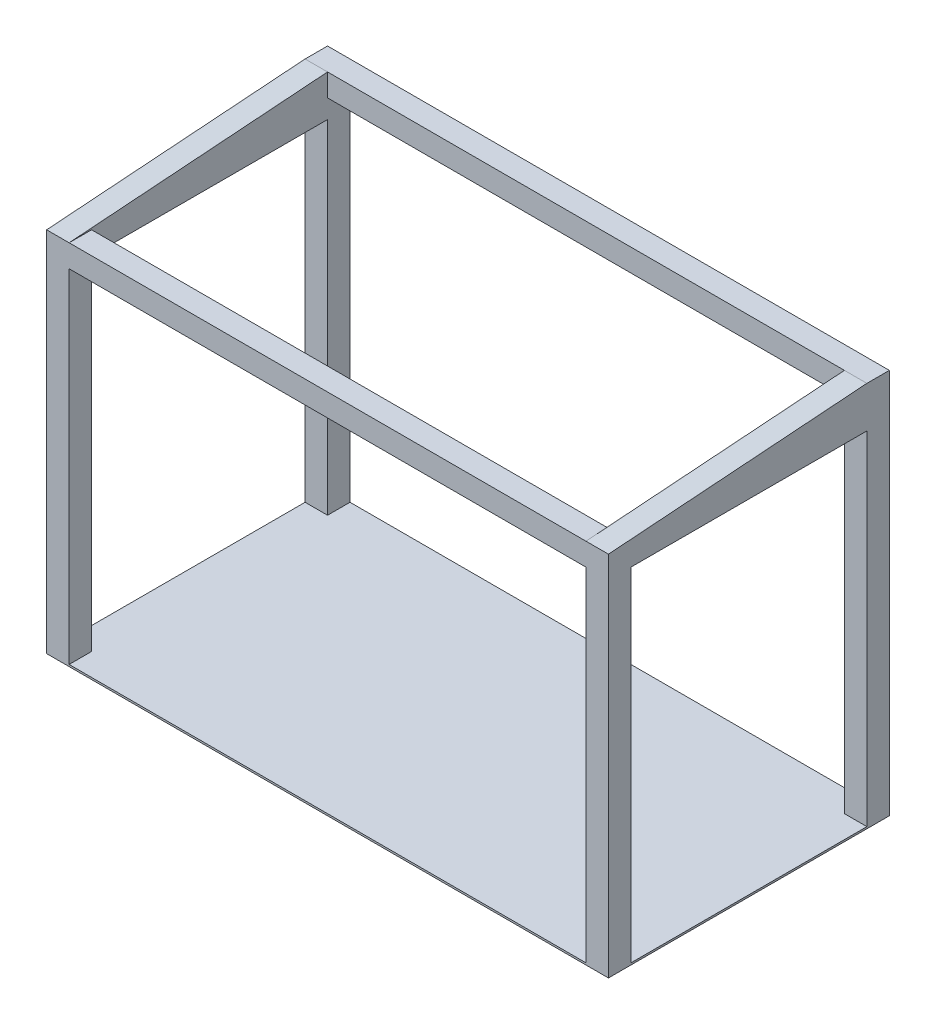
ISO-10303-21;
HEADER;
FILE_DESCRIPTION(('STEP AP214'),'2;1');
FILE_NAME('part.step','',(''),(''),'','','');
FILE_SCHEMA(('AUTOMOTIVE_DESIGN { 1 0 10303 214 1 1 1 1 }'));
ENDSEC;
DATA;
#1=APPLICATION_CONTEXT('core data for automotive mechanical design processes');
#2=APPLICATION_PROTOCOL_DEFINITION('international standard','automotive_design',2000,#1);
#3=PRODUCT_CONTEXT('',#1,'mechanical');
#4=PRODUCT('Part','Part','',(#3));
#5=PRODUCT_RELATED_PRODUCT_CATEGORY('part','',(#4));
#6=PRODUCT_DEFINITION_FORMATION('','',#4);
#7=PRODUCT_DEFINITION_CONTEXT('part definition',#1,'design');
#8=PRODUCT_DEFINITION('design','',#6,#7);
#9=PRODUCT_DEFINITION_SHAPE('','',#8);
#10=(LENGTH_UNIT() NAMED_UNIT(*) SI_UNIT(.MILLI.,.METRE.));
#11=(NAMED_UNIT(*) PLANE_ANGLE_UNIT() SI_UNIT($,.RADIAN.));
#12=(NAMED_UNIT(*) SI_UNIT($,.STERADIAN.) SOLID_ANGLE_UNIT());
#13=UNCERTAINTY_MEASURE_WITH_UNIT(LENGTH_MEASURE(1.E-05),#10,'distance_accuracy_value','');
#14=(GEOMETRIC_REPRESENTATION_CONTEXT(3) GLOBAL_UNCERTAINTY_ASSIGNED_CONTEXT((#13)) GLOBAL_UNIT_ASSIGNED_CONTEXT((#10,
#11,#12)) REPRESENTATION_CONTEXT('',''));
#15=CARTESIAN_POINT('',(0.,0.,0.));
#16=DIRECTION('',(0.,0.,1.));
#17=DIRECTION('',(1.,0.,0.));
#18=AXIS2_PLACEMENT_3D('',#15,#16,#17);
#19=CARTESIAN_POINT('',(-1380.,1960.,-750.));
#20=DIRECTION('',(-1.,0.,0.));
#21=DIRECTION('',(0.,0.,1.));
#22=AXIS2_PLACEMENT_3D('',#19,#20,#21);
#23=PLANE('',#22);
#24=DIRECTION('',(0.,0.,1.));
#25=VECTOR('',#24,1.);
#26=CARTESIAN_POINT('',(-1380.,1940.,-750.));
#27=LINE('',#26,#25);
#28=CARTESIAN_POINT('',(-1380.,1940.,-750.));
#29=VERTEX_POINT('',#28);
#30=CARTESIAN_POINT('',(-1380.,1940.,-630.000000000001));
#31=VERTEX_POINT('',#30);
#32=EDGE_CURVE('E186',#29,#31,#27,.T.);
#33=ORIENTED_EDGE('',*,*,#32,.T.);
#34=DIRECTION('',(0.,1.,0.));
#35=VECTOR('',#34,1.);
#36=CARTESIAN_POINT('',(-1380.,2060.,-630.000000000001));
#37=LINE('',#36,#35);
#38=CARTESIAN_POINT('',(-1380.,2060.,-630.000000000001));
#39=VERTEX_POINT('',#38);
#40=EDGE_CURVE('E197',#31,#39,#37,.T.);
#41=ORIENTED_EDGE('',*,*,#40,.T.);
#42=DIRECTION('',(0.,0.0722742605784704,-0.997384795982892));
#43=VECTOR('',#42,1.);
#44=CARTESIAN_POINT('',(-1380.,1960.,750.));
#45=LINE('',#44,#43);
#46=CARTESIAN_POINT('',(-1380.,1960.,750.));
#47=VERTEX_POINT('',#46);
#48=EDGE_CURVE('E284',#47,#39,#45,.T.);
#49=ORIENTED_EDGE('',*,*,#48,.F.);
#50=DIRECTION('',(0.,0.,1.));
#51=VECTOR('',#50,1.);
#52=CARTESIAN_POINT('',(-1380.,1960.,-630.000000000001));
#53=LINE('',#52,#51);
#54=CARTESIAN_POINT('',(-1380.,1960.,629.999999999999));
#55=VERTEX_POINT('',#54);
#56=EDGE_CURVE('E287',#55,#47,#53,.T.);
#57=ORIENTED_EDGE('',*,*,#56,.F.);
#58=DIRECTION('',(0.,1.,0.));
#59=VECTOR('',#58,1.);
#60=CARTESIAN_POINT('',(-1380.,1840.,629.999999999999));
#61=LINE('',#60,#59);
#62=CARTESIAN_POINT('',(-1380.,1840.,629.999999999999));
#63=VERTEX_POINT('',#62);
#64=EDGE_CURVE('E300',#63,#55,#61,.T.);
#65=ORIENTED_EDGE('',*,*,#64,.F.);
#66=DIRECTION('',(0.,0.,-1.));
#67=VECTOR('',#66,1.);
#68=CARTESIAN_POINT('',(-1380.,1840.,629.999999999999));
#69=LINE('',#68,#67);
#70=CARTESIAN_POINT('',(-1380.,1840.,-630.000000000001));
#71=VERTEX_POINT('',#70);
#72=EDGE_CURVE('E332',#63,#71,#69,.T.);
#73=ORIENTED_EDGE('',*,*,#72,.T.);
#74=DIRECTION('',(0.,-1.,0.));
#75=VECTOR('',#74,1.);
#76=CARTESIAN_POINT('',(-1380.,1960.,-630.));
#77=LINE('',#76,#75);
#78=CARTESIAN_POINT('',(-1380.,10.,-630.));
#79=VERTEX_POINT('',#78);
#80=EDGE_CURVE('E213',#71,#79,#77,.T.);
#81=ORIENTED_EDGE('',*,*,#80,.T.);
#82=DIRECTION('',(0.,0.,-1.));
#83=VECTOR('',#82,1.);
#84=CARTESIAN_POINT('',(-1380.,10.,-750.));
#85=LINE('',#84,#83);
#86=CARTESIAN_POINT('',(-1380.,10.,-750.));
#87=VERTEX_POINT('',#86);
#88=EDGE_CURVE('E212',#79,#87,#85,.T.);
#89=ORIENTED_EDGE('',*,*,#88,.T.);
#90=DIRECTION('',(0.,-1.,0.));
#91=VECTOR('',#90,1.);
#92=CARTESIAN_POINT('',(-1380.,1960.,-750.));
#93=LINE('',#92,#91);
#94=EDGE_CURVE('E205',#29,#87,#93,.T.);
#95=ORIENTED_EDGE('',*,*,#94,.F.);
#96=EDGE_LOOP('',(#33,#41,#49,#57,#65,#73,#81,#89,#95));
#97=FACE_BOUND('',#96,.T.);
#98=ADVANCED_FACE('F40',(#97),#23,.F.);
#99=CARTESIAN_POINT('',(1380.,1960.,-750.));
#100=DIRECTION('',(1.,0.,0.));
#101=DIRECTION('',(0.,0.,-1.));
#102=AXIS2_PLACEMENT_3D('',#99,#100,#101);
#103=PLANE('',#102);
#104=DIRECTION('',(0.,0.,1.));
#105=VECTOR('',#104,1.);
#106=CARTESIAN_POINT('',(1380.,1940.,-750.));
#107=LINE('',#106,#105);
#108=CARTESIAN_POINT('',(1380.,1940.,-750.));
#109=VERTEX_POINT('',#108);
#110=CARTESIAN_POINT('',(1380.,1940.,-630.000000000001));
#111=VERTEX_POINT('',#110);
#112=EDGE_CURVE('E414',#109,#111,#107,.T.);
#113=ORIENTED_EDGE('',*,*,#112,.F.);
#114=DIRECTION('',(0.,-1.,0.));
#115=VECTOR('',#114,1.);
#116=CARTESIAN_POINT('',(1380.,1960.,-750.));
#117=LINE('',#116,#115);
#118=CARTESIAN_POINT('',(1380.,10.,-750.));
#119=VERTEX_POINT('',#118);
#120=EDGE_CURVE('E207',#109,#119,#117,.T.);
#121=ORIENTED_EDGE('',*,*,#120,.T.);
#122=DIRECTION('',(0.,0.,1.));
#123=VECTOR('',#122,1.);
#124=CARTESIAN_POINT('',(1380.,10.,-750.));
#125=LINE('',#124,#123);
#126=CARTESIAN_POINT('',(1380.,10.,-630.));
#127=VERTEX_POINT('',#126);
#128=EDGE_CURVE('E362',#119,#127,#125,.T.);
#129=ORIENTED_EDGE('',*,*,#128,.T.);
#130=DIRECTION('',(0.,-1.,0.));
#131=VECTOR('',#130,1.);
#132=CARTESIAN_POINT('',(1380.,1960.,-630.));
#133=LINE('',#132,#131);
#134=CARTESIAN_POINT('',(1380.,1840.,-630.000000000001));
#135=VERTEX_POINT('',#134);
#136=EDGE_CURVE('E370',#135,#127,#133,.T.);
#137=ORIENTED_EDGE('',*,*,#136,.F.);
#138=DIRECTION('',(0.,0.,-1.));
#139=VECTOR('',#138,1.);
#140=CARTESIAN_POINT('',(1380.,1840.,629.999999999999));
#141=LINE('',#140,#139);
#142=CARTESIAN_POINT('',(1380.,1840.,629.999999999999));
#143=VERTEX_POINT('',#142);
#144=EDGE_CURVE('E327',#143,#135,#141,.T.);
#145=ORIENTED_EDGE('',*,*,#144,.F.);
#146=DIRECTION('',(0.,1.,0.));
#147=VECTOR('',#146,1.);
#148=CARTESIAN_POINT('',(1380.,1840.,629.999999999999));
#149=LINE('',#148,#147);
#150=CARTESIAN_POINT('',(1380.,1960.,629.999999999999));
#151=VERTEX_POINT('',#150);
#152=EDGE_CURVE('E301',#143,#151,#149,.T.);
#153=ORIENTED_EDGE('',*,*,#152,.T.);
#154=DIRECTION('',(0.,0.,-1.));
#155=VECTOR('',#154,1.);
#156=CARTESIAN_POINT('',(1380.,1960.,-630.000000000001));
#157=LINE('',#156,#155);
#158=CARTESIAN_POINT('',(1380.,1960.,750.));
#159=VERTEX_POINT('',#158);
#160=EDGE_CURVE('E277',#159,#151,#157,.T.);
#161=ORIENTED_EDGE('',*,*,#160,.F.);
#162=DIRECTION('',(0.,-0.0722742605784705,0.997384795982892));
#163=VECTOR('',#162,1.);
#164=CARTESIAN_POINT('',(1380.,1960.,750.));
#165=LINE('',#164,#163);
#166=CARTESIAN_POINT('',(1380.,2060.,-630.000000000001));
#167=VERTEX_POINT('',#166);
#168=EDGE_CURVE('E274',#167,#159,#165,.T.);
#169=ORIENTED_EDGE('',*,*,#168,.F.);
#170=DIRECTION('',(0.,1.,0.));
#171=VECTOR('',#170,1.);
#172=CARTESIAN_POINT('',(1380.,2060.,-630.000000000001));
#173=LINE('',#172,#171);
#174=EDGE_CURVE('E198',#111,#167,#173,.T.);
#175=ORIENTED_EDGE('',*,*,#174,.F.);
#176=EDGE_LOOP('',(#113,#121,#129,#137,#145,#153,#161,#169,#175));
#177=FACE_BOUND('',#176,.T.);
#178=ADVANCED_FACE('F411',(#177),#103,.F.);
#179=CARTESIAN_POINT('',(0.,1960.,0.));
#180=DIRECTION('',(0.,1.,0.));
#181=DIRECTION('',(0.,0.,1.));
#182=AXIS2_PLACEMENT_3D('',#179,#180,#181);
#183=PLANE('',#182);
#184=ORIENTED_EDGE('',*,*,#160,.T.);
#185=DIRECTION('',(-1.,0.,0.));
#186=VECTOR('',#185,1.);
#187=CARTESIAN_POINT('',(1380.,1960.,629.999999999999));
#188=LINE('',#187,#186);
#189=EDGE_CURVE('E316',#151,#55,#188,.T.);
#190=ORIENTED_EDGE('',*,*,#189,.T.);
#191=ORIENTED_EDGE('',*,*,#56,.T.);
#192=DIRECTION('',(1.,0.,0.));
#193=VECTOR('',#192,1.);
#194=CARTESIAN_POINT('',(1500.,1960.,750.));
#195=LINE('',#194,#193);
#196=EDGE_CURVE('E351',#47,#159,#195,.T.);
#197=ORIENTED_EDGE('',*,*,#196,.T.);
#198=EDGE_LOOP('',(#184,#190,#191,#197));
#199=FACE_BOUND('',#198,.T.);
#200=ADVANCED_FACE('F441',(#199),#183,.T.);
#201=DIRECTION('',(0.,0.,-1.));
#202=VECTOR('',#201,1.);
#203=CARTESIAN_POINT('',(-1380.,1840.,629.999999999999));
#204=LINE('',#203,#202);
#205=CARTESIAN_POINT('',(-1380.,1840.,750.));
#206=VERTEX_POINT('',#205);
#207=EDGE_CURVE('E305',#206,#63,#204,.T.);
#208=ORIENTED_EDGE('',*,*,#207,.F.);
#209=DIRECTION('',(0.,-1.,0.));
#210=VECTOR('',#209,1.);
#211=CARTESIAN_POINT('',(-1380.,1960.,750.));
#212=LINE('',#211,#210);
#213=CARTESIAN_POINT('',(-1380.,10.,750.));
#214=VERTEX_POINT('',#213);
#215=EDGE_CURVE('E345',#206,#214,#212,.T.);
#216=ORIENTED_EDGE('',*,*,#215,.T.);
#217=DIRECTION('',(0.,0.,-1.));
#218=VECTOR('',#217,1.);
#219=CARTESIAN_POINT('',(-1380.,10.,750.));
#220=LINE('',#219,#218);
#221=CARTESIAN_POINT('',(-1380.,10.,630.));
#222=VERTEX_POINT('',#221);
#223=EDGE_CURVE('E338',#214,#222,#220,.T.);
#224=ORIENTED_EDGE('',*,*,#223,.T.);
#225=DIRECTION('',(0.,-1.,0.));
#226=VECTOR('',#225,1.);
#227=CARTESIAN_POINT('',(-1380.,1960.,630.));
#228=LINE('',#227,#226);
#229=EDGE_CURVE('E55',#63,#222,#228,.T.);
#230=ORIENTED_EDGE('',*,*,#229,.F.);
#231=EDGE_LOOP('',(#208,#216,#224,#230));
#232=FACE_BOUND('',#231,.T.);
#233=ADVANCED_FACE('F386',(#232),#23,.F.);
#234=DIRECTION('',(0.,0.,-1.));
#235=VECTOR('',#234,1.);
#236=CARTESIAN_POINT('',(1380.,1840.,629.999999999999));
#237=LINE('',#236,#235);
#238=CARTESIAN_POINT('',(1380.,1840.,750.));
#239=VERTEX_POINT('',#238);
#240=EDGE_CURVE('E304',#239,#143,#237,.T.);
#241=ORIENTED_EDGE('',*,*,#240,.T.);
#242=DIRECTION('',(0.,-1.,0.));
#243=VECTOR('',#242,1.);
#244=CARTESIAN_POINT('',(1380.,1960.,630.));
#245=LINE('',#244,#243);
#246=CARTESIAN_POINT('',(1380.,10.,630.));
#247=VERTEX_POINT('',#246);
#248=EDGE_CURVE('E358',#143,#247,#245,.T.);
#249=ORIENTED_EDGE('',*,*,#248,.T.);
#250=DIRECTION('',(0.,0.,1.));
#251=VECTOR('',#250,1.);
#252=CARTESIAN_POINT('',(1380.,10.,750.));
#253=LINE('',#252,#251);
#254=CARTESIAN_POINT('',(1380.,10.,750.));
#255=VERTEX_POINT('',#254);
#256=EDGE_CURVE('E354',#247,#255,#253,.T.);
#257=ORIENTED_EDGE('',*,*,#256,.T.);
#258=DIRECTION('',(0.,-1.,0.));
#259=VECTOR('',#258,1.);
#260=CARTESIAN_POINT('',(1380.,1960.,750.));
#261=LINE('',#260,#259);
#262=EDGE_CURVE('E350',#239,#255,#261,.T.);
#263=ORIENTED_EDGE('',*,*,#262,.F.);
#264=EDGE_LOOP('',(#241,#249,#257,#263));
#265=FACE_BOUND('',#264,.T.);
#266=ADVANCED_FACE('F394',(#265),#103,.F.);
#267=CARTESIAN_POINT('',(1500.,1960.,-630.));
#268=DIRECTION('',(0.,0.,-1.));
#269=DIRECTION('',(-1.,0.,0.));
#270=AXIS2_PLACEMENT_3D('',#267,#268,#269);
#271=PLANE('',#270);
#272=DIRECTION('',(1.,0.,0.));
#273=VECTOR('',#272,1.);
#274=CARTESIAN_POINT('',(1380.,1840.,-630.000000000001));
#275=LINE('',#274,#273);
#276=CARTESIAN_POINT('',(1500.,1840.,-630.000000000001));
#277=VERTEX_POINT('',#276);
#278=EDGE_CURVE('E319',#135,#277,#275,.T.);
#279=ORIENTED_EDGE('',*,*,#278,.F.);
#280=ORIENTED_EDGE('',*,*,#136,.T.);
#281=DIRECTION('',(1.,0.,0.));
#282=VECTOR('',#281,1.);
#283=CARTESIAN_POINT('',(1500.,10.,-630.));
#284=LINE('',#283,#282);
#285=CARTESIAN_POINT('',(1500.,10.,-630.));
#286=VERTEX_POINT('',#285);
#287=EDGE_CURVE('E365',#127,#286,#284,.T.);
#288=ORIENTED_EDGE('',*,*,#287,.T.);
#289=DIRECTION('',(0.,-1.,0.));
#290=VECTOR('',#289,1.);
#291=CARTESIAN_POINT('',(1500.,1960.,-630.));
#292=LINE('',#291,#290);
#293=EDGE_CURVE('E368',#277,#286,#292,.T.);
#294=ORIENTED_EDGE('',*,*,#293,.F.);
#295=EDGE_LOOP('',(#279,#280,#288,#294));
#296=FACE_BOUND('',#295,.T.);
#297=ADVANCED_FACE('F407',(#296),#271,.F.);
#298=CARTESIAN_POINT('',(1500.,1960.,630.));
#299=DIRECTION('',(0.,0.,1.));
#300=DIRECTION('',(1.,0.,0.));
#301=AXIS2_PLACEMENT_3D('',#298,#299,#300);
#302=PLANE('',#301);
#303=DIRECTION('',(1.,0.,0.));
#304=VECTOR('',#303,1.);
#305=CARTESIAN_POINT('',(1380.,1840.,629.999999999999));
#306=LINE('',#305,#304);
#307=CARTESIAN_POINT('',(1500.,1840.,629.999999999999));
#308=VERTEX_POINT('',#307);
#309=EDGE_CURVE('E320',#143,#308,#306,.T.);
#310=ORIENTED_EDGE('',*,*,#309,.T.);
#311=DIRECTION('',(0.,-1.,0.));
#312=VECTOR('',#311,1.);
#313=CARTESIAN_POINT('',(1500.,1960.,630.));
#314=LINE('',#313,#312);
#315=CARTESIAN_POINT('',(1500.,10.,630.));
#316=VERTEX_POINT('',#315);
#317=EDGE_CURVE('E360',#308,#316,#314,.T.);
#318=ORIENTED_EDGE('',*,*,#317,.T.);
#319=DIRECTION('',(-1.,0.,0.));
#320=VECTOR('',#319,1.);
#321=CARTESIAN_POINT('',(1500.,10.,630.));
#322=LINE('',#321,#320);
#323=EDGE_CURVE('E347',#316,#247,#322,.T.);
#324=ORIENTED_EDGE('',*,*,#323,.T.);
#325=ORIENTED_EDGE('',*,*,#248,.F.);
#326=EDGE_LOOP('',(#310,#318,#324,#325));
#327=FACE_BOUND('',#326,.T.);
#328=ADVANCED_FACE('F399',(#327),#302,.F.);
#329=CARTESIAN_POINT('',(-1500.,1960.,-630.));
#330=DIRECTION('',(0.,0.,-1.));
#331=DIRECTION('',(-1.,0.,0.));
#332=AXIS2_PLACEMENT_3D('',#329,#330,#331);
#333=PLANE('',#332);
#334=DIRECTION('',(1.,0.,0.));
#335=VECTOR('',#334,1.);
#336=CARTESIAN_POINT('',(-1500.,1840.,-630.000000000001));
#337=LINE('',#336,#335);
#338=CARTESIAN_POINT('',(-1500.,1840.,-630.000000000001));
#339=VERTEX_POINT('',#338);
#340=EDGE_CURVE('E329',#339,#71,#337,.T.);
#341=ORIENTED_EDGE('',*,*,#340,.F.);
#342=DIRECTION('',(0.,-1.,0.));
#343=VECTOR('',#342,1.);
#344=CARTESIAN_POINT('',(-1500.,1960.,-630.));
#345=LINE('',#344,#343);
#346=CARTESIAN_POINT('',(-1500.,10.,-630.));
#347=VERTEX_POINT('',#346);
#348=EDGE_CURVE('E215',#339,#347,#345,.T.);
#349=ORIENTED_EDGE('',*,*,#348,.T.);
#350=DIRECTION('',(1.,0.,0.));
#351=VECTOR('',#350,1.);
#352=CARTESIAN_POINT('',(-1500.,10.,-630.));
#353=LINE('',#352,#351);
#354=EDGE_CURVE('E217',#347,#79,#353,.T.);
#355=ORIENTED_EDGE('',*,*,#354,.T.);
#356=ORIENTED_EDGE('',*,*,#80,.F.);
#357=EDGE_LOOP('',(#341,#349,#355,#356));
#358=FACE_BOUND('',#357,.T.);
#359=ADVANCED_FACE('F377',(#358),#333,.F.);
#360=CARTESIAN_POINT('',(-1500.,1960.,630.));
#361=DIRECTION('',(0.,0.,1.));
#362=DIRECTION('',(1.,0.,0.));
#363=AXIS2_PLACEMENT_3D('',#360,#361,#362);
#364=PLANE('',#363);
#365=DIRECTION('',(1.,0.,0.));
#366=VECTOR('',#365,1.);
#367=CARTESIAN_POINT('',(-1500.,1840.,629.999999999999));
#368=LINE('',#367,#366);
#369=CARTESIAN_POINT('',(-1500.,1840.,629.999999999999));
#370=VERTEX_POINT('',#369);
#371=EDGE_CURVE('E330',#370,#63,#368,.T.);
#372=ORIENTED_EDGE('',*,*,#371,.T.);
#373=ORIENTED_EDGE('',*,*,#229,.T.);
#374=DIRECTION('',(-1.,0.,0.));
#375=VECTOR('',#374,1.);
#376=CARTESIAN_POINT('',(-1500.,10.,630.));
#377=LINE('',#376,#375);
#378=CARTESIAN_POINT('',(-1500.,10.,630.));
#379=VERTEX_POINT('',#378);
#380=EDGE_CURVE('E341',#222,#379,#377,.T.);
#381=ORIENTED_EDGE('',*,*,#380,.T.);
#382=DIRECTION('',(0.,-1.,0.));
#383=VECTOR('',#382,1.);
#384=CARTESIAN_POINT('',(-1500.,1960.,630.));
#385=LINE('',#384,#383);
#386=EDGE_CURVE('E63',#370,#379,#385,.T.);
#387=ORIENTED_EDGE('',*,*,#386,.F.);
#388=EDGE_LOOP('',(#372,#373,#381,#387));
#389=FACE_BOUND('',#388,.T.);
#390=ADVANCED_FACE('F383',(#389),#364,.F.);
#391=CARTESIAN_POINT('',(0.,10.,0.));
#392=DIRECTION('',(0.,-1.,0.));
#393=DIRECTION('',(0.,0.,-1.));
#394=AXIS2_PLACEMENT_3D('',#391,#392,#393);
#395=PLANE('',#394);
#396=ORIENTED_EDGE('',*,*,#223,.F.);
#397=DIRECTION('',(1.,0.,0.));
#398=VECTOR('',#397,1.);
#399=CARTESIAN_POINT('',(-1500.,10.,750.));
#400=LINE('',#399,#398);
#401=EDGE_CURVE('E231',#214,#255,#400,.T.);
#402=ORIENTED_EDGE('',*,*,#401,.T.);
#403=ORIENTED_EDGE('',*,*,#256,.F.);
#404=ORIENTED_EDGE('',*,*,#323,.F.);
#405=DIRECTION('',(0.,0.,-1.));
#406=VECTOR('',#405,1.);
#407=CARTESIAN_POINT('',(1500.,10.,750.));
#408=LINE('',#407,#406);
#409=EDGE_CURVE('E223',#316,#286,#408,.T.);
#410=ORIENTED_EDGE('',*,*,#409,.T.);
#411=ORIENTED_EDGE('',*,*,#287,.F.);
#412=ORIENTED_EDGE('',*,*,#128,.F.);
#413=DIRECTION('',(-1.,0.,0.));
#414=VECTOR('',#413,1.);
#415=CARTESIAN_POINT('',(-1500.,10.,-750.));
#416=LINE('',#415,#414);
#417=EDGE_CURVE('E226',#119,#87,#416,.T.);
#418=ORIENTED_EDGE('',*,*,#417,.T.);
#419=ORIENTED_EDGE('',*,*,#88,.F.);
#420=ORIENTED_EDGE('',*,*,#354,.F.);
#421=DIRECTION('',(0.,0.,1.));
#422=VECTOR('',#421,1.);
#423=CARTESIAN_POINT('',(-1500.,10.,750.));
#424=LINE('',#423,#422);
#425=EDGE_CURVE('E229',#347,#379,#424,.T.);
#426=ORIENTED_EDGE('',*,*,#425,.T.);
#427=ORIENTED_EDGE('',*,*,#380,.F.);
#428=EDGE_LOOP('',(#396,#402,#403,#404,#410,#411,#412,#418,#419,#420,#426,#427));
#429=FACE_BOUND('',#428,.T.);
#430=ADVANCED_FACE('F381',(#429),#395,.F.);
#431=CARTESIAN_POINT('',(1500.,10.,750.));
#432=DIRECTION('',(-1.,0.,0.));
#433=DIRECTION('',(0.,0.,1.));
#434=AXIS2_PLACEMENT_3D('',#431,#432,#433);
#435=PLANE('',#434);
#436=DIRECTION('',(0.,0.,-1.));
#437=VECTOR('',#436,1.);
#438=CARTESIAN_POINT('',(1500.,1840.,629.999999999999));
#439=LINE('',#438,#437);
#440=EDGE_CURVE('E323',#308,#277,#439,.T.);
#441=ORIENTED_EDGE('',*,*,#440,.T.);
#442=ORIENTED_EDGE('',*,*,#293,.T.);
#443=ORIENTED_EDGE('',*,*,#409,.F.);
#444=ORIENTED_EDGE('',*,*,#317,.F.);
#445=EDGE_LOOP('',(#441,#442,#443,#444));
#446=FACE_BOUND('',#445,.T.);
#447=DIRECTION('',(0.,0.,-1.));
#448=VECTOR('',#447,1.);
#449=CARTESIAN_POINT('',(1500.,0.,750.));
#450=LINE('',#449,#448);
#451=CARTESIAN_POINT('',(1500.,0.,750.));
#452=VERTEX_POINT('',#451);
#453=CARTESIAN_POINT('',(1500.,0.,-750.));
#454=VERTEX_POINT('',#453);
#455=EDGE_CURVE('E222',#452,#454,#450,.T.);
#456=ORIENTED_EDGE('',*,*,#455,.T.);
#457=DIRECTION('',(0.,-1.,0.));
#458=VECTOR('',#457,1.);
#459=CARTESIAN_POINT('',(1500.,10.,-750.));
#460=LINE('',#459,#458);
#461=CARTESIAN_POINT('',(1500.,2060.,-750.));
#462=VERTEX_POINT('',#461);
#463=EDGE_CURVE('E11',#462,#454,#460,.T.);
#464=ORIENTED_EDGE('',*,*,#463,.F.);
#465=DIRECTION('',(0.,0.,-1.));
#466=VECTOR('',#465,1.);
#467=CARTESIAN_POINT('',(1500.,2060.,-630.000000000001));
#468=LINE('',#467,#466);
#469=CARTESIAN_POINT('',(1500.,2060.,-630.000000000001));
#470=VERTEX_POINT('',#469);
#471=EDGE_CURVE('E270',#470,#462,#468,.T.);
#472=ORIENTED_EDGE('',*,*,#471,.F.);
#473=DIRECTION('',(0.,-0.0722742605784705,0.997384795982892));
#474=VECTOR('',#473,1.);
#475=CARTESIAN_POINT('',(1500.,1960.,750.));
#476=LINE('',#475,#474);
#477=CARTESIAN_POINT('',(1500.,1960.,750.));
#478=VERTEX_POINT('',#477);
#479=EDGE_CURVE('E208',#470,#478,#476,.T.);
#480=ORIENTED_EDGE('',*,*,#479,.T.);
#481=DIRECTION('',(0.,-1.,0.));
#482=VECTOR('',#481,1.);
#483=CARTESIAN_POINT('',(1500.,10.,750.));
#484=LINE('',#483,#482);
#485=EDGE_CURVE('E234',#478,#452,#484,.T.);
#486=ORIENTED_EDGE('',*,*,#485,.T.);
#487=EDGE_LOOP('',(#456,#464,#472,#480,#486));
#488=FACE_BOUND('',#487,.T.);
#489=ADVANCED_FACE('F42',(#446,#488),#435,.F.);
#490=CARTESIAN_POINT('',(-1500.,10.,-750.));
#491=DIRECTION('',(0.,0.,1.));
#492=DIRECTION('',(1.,0.,0.));
#493=AXIS2_PLACEMENT_3D('',#490,#491,#492);
#494=PLANE('',#493);
#495=DIRECTION('',(1.,0.,0.));
#496=VECTOR('',#495,1.);
#497=CARTESIAN_POINT('',(-1380.,1940.,-750.));
#498=LINE('',#497,#496);
#499=EDGE_CURVE('E189',#29,#109,#498,.T.);
#500=ORIENTED_EDGE('',*,*,#499,.F.);
#501=ORIENTED_EDGE('',*,*,#94,.T.);
#502=ORIENTED_EDGE('',*,*,#417,.F.);
#503=ORIENTED_EDGE('',*,*,#120,.F.);
#504=EDGE_LOOP('',(#500,#501,#502,#503));
#505=FACE_BOUND('',#504,.T.);
#506=DIRECTION('',(-1.,0.,0.));
#507=VECTOR('',#506,1.);
#508=CARTESIAN_POINT('',(-1500.,0.,-750.));
#509=LINE('',#508,#507);
#510=CARTESIAN_POINT('',(-1500.,0.,-750.));
#511=VERTEX_POINT('',#510);
#512=EDGE_CURVE('E237',#454,#511,#509,.T.);
#513=ORIENTED_EDGE('',*,*,#512,.T.);
#514=DIRECTION('',(0.,-1.,0.));
#515=VECTOR('',#514,1.);
#516=CARTESIAN_POINT('',(-1500.,10.,-750.));
#517=LINE('',#516,#515);
#518=CARTESIAN_POINT('',(-1500.,2060.,-750.));
#519=VERTEX_POINT('',#518);
#520=EDGE_CURVE('E48',#519,#511,#517,.T.);
#521=ORIENTED_EDGE('',*,*,#520,.F.);
#522=DIRECTION('',(-1.,0.,0.));
#523=VECTOR('',#522,1.);
#524=CARTESIAN_POINT('',(1500.,2060.,-750.));
#525=LINE('',#524,#523);
#526=EDGE_CURVE('E296',#462,#519,#525,.T.);
#527=ORIENTED_EDGE('',*,*,#526,.F.);
#528=ORIENTED_EDGE('',*,*,#463,.T.);
#529=EDGE_LOOP('',(#513,#521,#527,#528));
#530=FACE_BOUND('',#529,.T.);
#531=ADVANCED_FACE('F202',(#505,#530),#494,.F.);
#532=CARTESIAN_POINT('',(-1500.,10.,750.));
#533=DIRECTION('',(1.,0.,0.));
#534=DIRECTION('',(0.,0.,-1.));
#535=AXIS2_PLACEMENT_3D('',#532,#533,#534);
#536=PLANE('',#535);
#537=DIRECTION('',(0.,-1.,0.));
#538=VECTOR('',#537,1.);
#539=CARTESIAN_POINT('',(-1500.,10.,750.));
#540=LINE('',#539,#538);
#541=CARTESIAN_POINT('',(-1500.,1960.,750.));
#542=VERTEX_POINT('',#541);
#543=CARTESIAN_POINT('',(-1500.,0.,750.));
#544=VERTEX_POINT('',#543);
#545=EDGE_CURVE('E244',#542,#544,#540,.T.);
#546=ORIENTED_EDGE('',*,*,#545,.F.);
#547=DIRECTION('',(0.,0.0722742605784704,-0.997384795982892));
#548=VECTOR('',#547,1.);
#549=CARTESIAN_POINT('',(-1500.,1960.,750.));
#550=LINE('',#549,#548);
#551=CARTESIAN_POINT('',(-1500.,2060.,-630.000000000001));
#552=VERTEX_POINT('',#551);
#553=EDGE_CURVE('E283',#542,#552,#550,.T.);
#554=ORIENTED_EDGE('',*,*,#553,.T.);
#555=DIRECTION('',(0.,0.,1.));
#556=VECTOR('',#555,1.);
#557=CARTESIAN_POINT('',(-1500.,2060.,-630.000000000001));
#558=LINE('',#557,#556);
#559=EDGE_CURVE('E255',#519,#552,#558,.T.);
#560=ORIENTED_EDGE('',*,*,#559,.F.);
#561=ORIENTED_EDGE('',*,*,#520,.T.);
#562=DIRECTION('',(0.,0.,1.));
#563=VECTOR('',#562,1.);
#564=CARTESIAN_POINT('',(-1500.,0.,750.));
#565=LINE('',#564,#563);
#566=EDGE_CURVE('E239',#511,#544,#565,.T.);
#567=ORIENTED_EDGE('',*,*,#566,.T.);
#568=EDGE_LOOP('',(#546,#554,#560,#561,#567));
#569=FACE_BOUND('',#568,.T.);
#570=ORIENTED_EDGE('',*,*,#348,.F.);
#571=DIRECTION('',(0.,0.,-1.));
#572=VECTOR('',#571,1.);
#573=CARTESIAN_POINT('',(-1500.,1840.,629.999999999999));
#574=LINE('',#573,#572);
#575=EDGE_CURVE('E336',#370,#339,#574,.T.);
#576=ORIENTED_EDGE('',*,*,#575,.F.);
#577=ORIENTED_EDGE('',*,*,#386,.T.);
#578=ORIENTED_EDGE('',*,*,#425,.F.);
#579=EDGE_LOOP('',(#570,#576,#577,#578));
#580=FACE_BOUND('',#579,.T.);
#581=ADVANCED_FACE('F252',(#569,#580),#536,.F.);
#582=CARTESIAN_POINT('',(-1500.,10.,750.));
#583=DIRECTION('',(0.,0.,-1.));
#584=DIRECTION('',(-1.,0.,0.));
#585=AXIS2_PLACEMENT_3D('',#582,#583,#584);
#586=PLANE('',#585);
#587=ORIENTED_EDGE('',*,*,#215,.F.);
#588=DIRECTION('',(-1.,0.,0.));
#589=VECTOR('',#588,1.);
#590=CARTESIAN_POINT('',(1380.,1840.,750.));
#591=LINE('',#590,#589);
#592=EDGE_CURVE('E314',#239,#206,#591,.T.);
#593=ORIENTED_EDGE('',*,*,#592,.F.);
#594=ORIENTED_EDGE('',*,*,#262,.T.);
#595=ORIENTED_EDGE('',*,*,#401,.F.);
#596=EDGE_LOOP('',(#587,#593,#594,#595));
#597=FACE_BOUND('',#596,.T.);
#598=DIRECTION('',(1.,0.,0.));
#599=VECTOR('',#598,1.);
#600=CARTESIAN_POINT('',(-1500.,0.,750.));
#601=LINE('',#600,#599);
#602=EDGE_CURVE('E227',#544,#452,#601,.T.);
#603=ORIENTED_EDGE('',*,*,#602,.T.);
#604=ORIENTED_EDGE('',*,*,#485,.F.);
#605=DIRECTION('',(1.,0.,0.));
#606=VECTOR('',#605,1.);
#607=CARTESIAN_POINT('',(1380.,1960.,750.));
#608=LINE('',#607,#606);
#609=EDGE_CURVE('E281',#159,#478,#608,.T.);
#610=ORIENTED_EDGE('',*,*,#609,.F.);
#611=ORIENTED_EDGE('',*,*,#196,.F.);
#612=EDGE_CURVE('E348',#542,#47,#195,.T.);
#613=ORIENTED_EDGE('',*,*,#612,.F.);
#614=ORIENTED_EDGE('',*,*,#545,.T.);
#615=EDGE_LOOP('',(#603,#604,#610,#611,#613,#614));
#616=FACE_BOUND('',#615,.T.);
#617=ADVANCED_FACE('F263',(#597,#616),#586,.F.);
#618=CARTESIAN_POINT('',(0.,0.,0.));
#619=DIRECTION('',(0.,-1.,0.));
#620=DIRECTION('',(0.,0.,-1.));
#621=AXIS2_PLACEMENT_3D('',#618,#619,#620);
#622=PLANE('',#621);
#623=ORIENTED_EDGE('',*,*,#455,.F.);
#624=ORIENTED_EDGE('',*,*,#602,.F.);
#625=ORIENTED_EDGE('',*,*,#566,.F.);
#626=ORIENTED_EDGE('',*,*,#512,.F.);
#627=EDGE_LOOP('',(#623,#624,#625,#626));
#628=FACE_BOUND('',#627,.T.);
#629=ADVANCED_FACE('F260',(#628),#622,.T.);
#630=CARTESIAN_POINT('',(-1500.,1840.,629.999999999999));
#631=DIRECTION('',(0.,1.,0.));
#632=DIRECTION('',(0.,0.,1.));
#633=AXIS2_PLACEMENT_3D('',#630,#631,#632);
#634=PLANE('',#633);
#635=ORIENTED_EDGE('',*,*,#340,.T.);
#636=ORIENTED_EDGE('',*,*,#72,.F.);
#637=ORIENTED_EDGE('',*,*,#371,.F.);
#638=ORIENTED_EDGE('',*,*,#575,.T.);
#639=EDGE_LOOP('',(#635,#636,#637,#638));
#640=FACE_BOUND('',#639,.T.);
#641=ADVANCED_FACE('F460',(#640),#634,.F.);
#642=CARTESIAN_POINT('',(1380.,1840.,629.999999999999));
#643=DIRECTION('',(0.,1.,0.));
#644=DIRECTION('',(0.,0.,1.));
#645=AXIS2_PLACEMENT_3D('',#642,#643,#644);
#646=PLANE('',#645);
#647=ORIENTED_EDGE('',*,*,#278,.T.);
#648=ORIENTED_EDGE('',*,*,#440,.F.);
#649=ORIENTED_EDGE('',*,*,#309,.F.);
#650=ORIENTED_EDGE('',*,*,#144,.T.);
#651=EDGE_LOOP('',(#647,#648,#649,#650));
#652=FACE_BOUND('',#651,.T.);
#653=ADVANCED_FACE('F463',(#652),#646,.F.);
#654=CARTESIAN_POINT('',(1380.,1840.,629.999999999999));
#655=DIRECTION('',(0.,0.,1.));
#656=DIRECTION('',(1.,0.,0.));
#657=AXIS2_PLACEMENT_3D('',#654,#655,#656);
#658=PLANE('',#657);
#659=ORIENTED_EDGE('',*,*,#64,.T.);
#660=ORIENTED_EDGE('',*,*,#189,.F.);
#661=ORIENTED_EDGE('',*,*,#152,.F.);
#662=DIRECTION('',(-1.,0.,0.));
#663=VECTOR('',#662,1.);
#664=CARTESIAN_POINT('',(1380.,1840.,629.999999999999));
#665=LINE('',#664,#663);
#666=EDGE_CURVE('E308',#143,#63,#665,.T.);
#667=ORIENTED_EDGE('',*,*,#666,.T.);
#668=EDGE_LOOP('',(#659,#660,#661,#667));
#669=FACE_BOUND('',#668,.T.);
#670=ADVANCED_FACE('F466',(#669),#658,.F.);
#671=CARTESIAN_POINT('',(1380.,1840.,629.999999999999));
#672=DIRECTION('',(0.,1.,0.));
#673=DIRECTION('',(0.,0.,1.));
#674=AXIS2_PLACEMENT_3D('',#671,#672,#673);
#675=PLANE('',#674);
#676=ORIENTED_EDGE('',*,*,#207,.T.);
#677=ORIENTED_EDGE('',*,*,#666,.F.);
#678=ORIENTED_EDGE('',*,*,#240,.F.);
#679=ORIENTED_EDGE('',*,*,#592,.T.);
#680=EDGE_LOOP('',(#676,#677,#678,#679));
#681=FACE_BOUND('',#680,.T.);
#682=ADVANCED_FACE('F470',(#681),#675,.F.);
#683=CARTESIAN_POINT('',(0.,2060.,0.));
#684=DIRECTION('',(0.,1.,0.));
#685=DIRECTION('',(0.,0.,1.));
#686=AXIS2_PLACEMENT_3D('',#683,#684,#685);
#687=PLANE('',#686);
#688=ORIENTED_EDGE('',*,*,#471,.T.);
#689=ORIENTED_EDGE('',*,*,#526,.T.);
#690=ORIENTED_EDGE('',*,*,#559,.T.);
#691=DIRECTION('',(1.,0.,0.));
#692=VECTOR('',#691,1.);
#693=CARTESIAN_POINT('',(-1500.,2060.,-630.000000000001));
#694=LINE('',#693,#692);
#695=EDGE_CURVE('E292',#552,#39,#694,.T.);
#696=ORIENTED_EDGE('',*,*,#695,.T.);
#697=DIRECTION('',(1.,0.,0.));
#698=VECTOR('',#697,1.);
#699=CARTESIAN_POINT('',(-1380.,2060.,-630.000000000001));
#700=LINE('',#699,#698);
#701=EDGE_CURVE('E421',#39,#167,#700,.T.);
#702=ORIENTED_EDGE('',*,*,#701,.T.);
#703=DIRECTION('',(1.,0.,0.));
#704=VECTOR('',#703,1.);
#705=CARTESIAN_POINT('',(1500.,2060.,-630.000000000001));
#706=LINE('',#705,#704);
#707=EDGE_CURVE('E298',#167,#470,#706,.T.);
#708=ORIENTED_EDGE('',*,*,#707,.T.);
#709=EDGE_LOOP('',(#688,#689,#690,#696,#702,#708));
#710=FACE_BOUND('',#709,.T.);
#711=ADVANCED_FACE('F429',(#710),#687,.T.);
#712=CARTESIAN_POINT('',(-1380.,1960.,750.));
#713=DIRECTION('',(0.,0.997384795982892,0.0722742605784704));
#714=DIRECTION('',(0.,-0.0722742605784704,0.997384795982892));
#715=AXIS2_PLACEMENT_3D('',#712,#713,#714);
#716=PLANE('',#715);
#717=ORIENTED_EDGE('',*,*,#553,.F.);
#718=ORIENTED_EDGE('',*,*,#612,.T.);
#719=ORIENTED_EDGE('',*,*,#48,.T.);
#720=ORIENTED_EDGE('',*,*,#695,.F.);
#721=EDGE_LOOP('',(#717,#718,#719,#720));
#722=FACE_BOUND('',#721,.T.);
#723=ADVANCED_FACE('F427',(#722),#716,.T.);
#724=CARTESIAN_POINT('',(1380.,1960.,750.));
#725=DIRECTION('',(0.,0.997384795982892,0.0722742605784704));
#726=DIRECTION('',(0.,-0.0722742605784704,0.997384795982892));
#727=AXIS2_PLACEMENT_3D('',#724,#725,#726);
#728=PLANE('',#727);
#729=ORIENTED_EDGE('',*,*,#479,.F.);
#730=ORIENTED_EDGE('',*,*,#707,.F.);
#731=ORIENTED_EDGE('',*,*,#168,.T.);
#732=ORIENTED_EDGE('',*,*,#609,.T.);
#733=EDGE_LOOP('',(#729,#730,#731,#732));
#734=FACE_BOUND('',#733,.T.);
#735=ADVANCED_FACE('F479',(#734),#728,.T.);
#736=CARTESIAN_POINT('',(-1380.,1940.,-750.));
#737=DIRECTION('',(0.,1.,0.));
#738=DIRECTION('',(0.,0.,1.));
#739=AXIS2_PLACEMENT_3D('',#736,#737,#738);
#740=PLANE('',#739);
#741=ORIENTED_EDGE('',*,*,#112,.T.);
#742=DIRECTION('',(1.,0.,0.));
#743=VECTOR('',#742,1.);
#744=CARTESIAN_POINT('',(-1380.,1940.,-630.000000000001));
#745=LINE('',#744,#743);
#746=EDGE_CURVE('E192',#31,#111,#745,.T.);
#747=ORIENTED_EDGE('',*,*,#746,.F.);
#748=ORIENTED_EDGE('',*,*,#32,.F.);
#749=ORIENTED_EDGE('',*,*,#499,.T.);
#750=EDGE_LOOP('',(#741,#747,#748,#749));
#751=FACE_BOUND('',#750,.T.);
#752=ADVANCED_FACE('F188',(#751),#740,.F.);
#753=CARTESIAN_POINT('',(-1380.,2060.,-630.000000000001));
#754=DIRECTION('',(0.,0.,-1.));
#755=DIRECTION('',(-1.,0.,0.));
#756=AXIS2_PLACEMENT_3D('',#753,#754,#755);
#757=PLANE('',#756);
#758=ORIENTED_EDGE('',*,*,#174,.T.);
#759=ORIENTED_EDGE('',*,*,#701,.F.);
#760=ORIENTED_EDGE('',*,*,#40,.F.);
#761=ORIENTED_EDGE('',*,*,#746,.T.);
#762=EDGE_LOOP('',(#758,#759,#760,#761));
#763=FACE_BOUND('',#762,.T.);
#764=ADVANCED_FACE('F424',(#763),#757,.F.);
#765=CLOSED_SHELL('',(#98,#178,#200,#233,#266,#297,#328,#359,#390,#430,#489,#531,#581,#617,#629,
#641,#653,#670,#682,#711,#723,#735,#752,#764));
#766=MANIFOLD_SOLID_BREP('B2',#765);
#767=ADVANCED_BREP_SHAPE_REPRESENTATION('',(#18,#766),#14);
#768=SHAPE_DEFINITION_REPRESENTATION(#9,#767);
ENDSEC;
END-ISO-10303-21;
